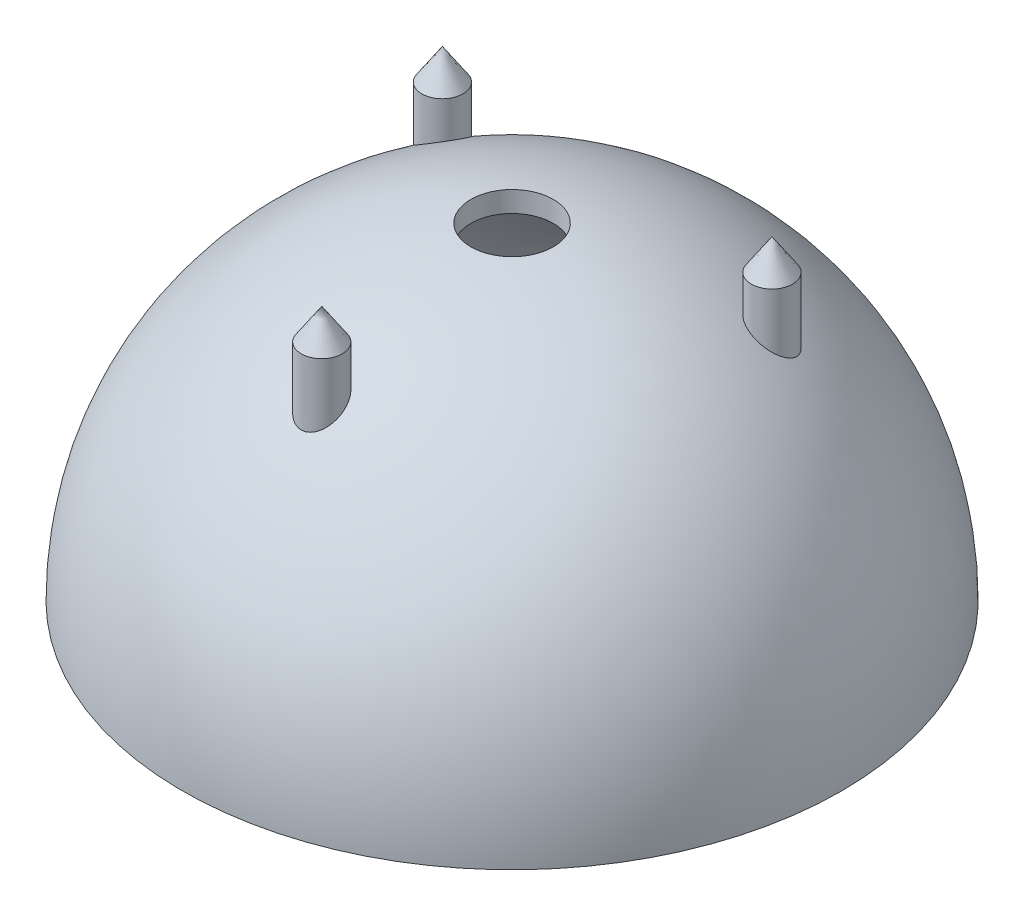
from build123d import *

# Parameters (mm, degrees)
EXTRUDE1_REACH      = 71.665
EXTRUDE1_END_RADIUS = 40.64
SKETCH2_R           = 2.54
SKETCH4_R           = 5.08
EXTRUDE3_DEPTH      = 71.39054482
CIRPATTERN1_COUNT   = 3


with BuildPart() as part:
    # Sketch1 → Revolve1 (revolve)
    with BuildSketch(Plane.XY, mode=Mode.PRIVATE) as revolve1_sk:
        with BuildLine():
            Line((38.1, 0), (40.64, 0))
            ThreePointArc((40.64, 0), (28.736819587, 28.736819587), (0, 40.64))
            Line((0, 40.64), (0, 38.1))
            ThreePointArc((0, 38.1), (26.940768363, 26.940768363), (38.1, 0))
        make_face()
    revolve(revolve1_sk.sketch.rotate(Axis((0, 38.1, 0), (0, 1, 0)), 180), axis=Axis((0, 38.1, 0), (0, 1, 0)))

    # Extrude1: up to this sphere (the profile starts outside it)
    extrude1_end = Location((0, 0, 0)) * Sphere(EXTRUDE1_END_RADIUS, mode=Mode.PRIVATE)
    # Sketch2 → Extrude1 (add, up to the surface)
    with BuildSketch(Plane.XZ.offset(-39.37), mode=Mode.PRIVATE) as extrude1_sk1:
        with Locations(Location((0, 23.46351494, 0), (0, 0, 210.371063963))):
            Circle(SKETCH2_R)
    extrude1_tool1 = extrude(extrude1_sk1.sketch, amount=EXTRUDE1_REACH, mode=Mode.PRIVATE) - extrude1_end
    add(extrude1_tool1.solids().sort_by_distance((0, 39.37, 23.463515))[0])
    # Sketch2 → Extrude1 (add, up to the surface)
    with BuildSketch(Plane.XZ.offset(-39.37), mode=Mode.PRIVATE) as extrude1_sk2:
        with Locations(Location((-20.32, -11.73175747, 0), (0, 0, 218.847085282))):
            Circle(SKETCH2_R)
    extrude1_tool2 = extrude(extrude1_sk2.sketch, amount=EXTRUDE1_REACH, mode=Mode.PRIVATE) - extrude1_end
    add(extrude1_tool2.solids().sort_by_distance((-20.32, 39.37, -11.731757))[0])
    # Sketch2 → Extrude1 (add, up to the surface)
    with BuildSketch(Plane.XZ.offset(-39.37), mode=Mode.PRIVATE) as extrude1_sk3:
        with Locations(Location((20.32, -11.73175747, 0), (0, 0, 321.276243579))):
            Circle(SKETCH2_R)
    extrude1_tool3 = extrude(extrude1_sk3.sketch, amount=EXTRUDE1_REACH, mode=Mode.PRIVATE) - extrude1_end
    add(extrude1_tool3.solids().sort_by_distance((20.32, 39.37, -11.731757))[0])

    # Sketch4 → Extrude3 (cut, through all)
    with BuildSketch(Plane.XZ):
        Circle(SKETCH4_R)
    extrude(amount=-EXTRUDE3_DEPTH, mode=Mode.SUBTRACT)

    # Sketch5 → Revolve2 (revolve)
    with BuildSketch(Plane(origin=(0, 0, 0), x_dir=(0, 0, -1), z_dir=(1, 0, 0))):
        Polygon((-20.92351494, 39.37), (-23.46351494, 43.18), (-23.46351494, 39.37), align=None)
    revolve2 = revolve(axis=Axis((0, 39.37, 23.46351494), (0, 1, 0)))

    # CirPattern1: Revolve2 ×3 about axis
    cirpattern1_axis = Axis((0, 0, 0), (0, 1, 0))
    for i in range(1, CIRPATTERN1_COUNT):
        add(revolve2.rotate(cirpattern1_axis, i * 360 / CIRPATTERN1_COUNT))


solid = part.part
